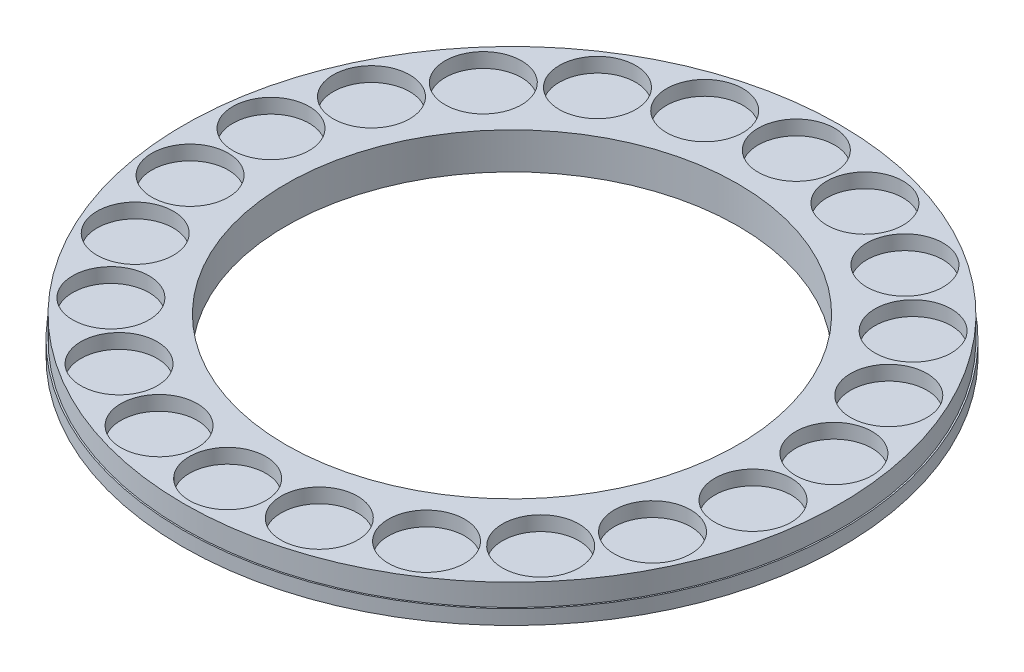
from build123d import *

# Parameters (mm, degrees)
SKETCH1_R          = 285.75
EXTRUDE1_DEPTH     = 19.05
SKETCH2_R          = 287.02
EXTRUDE2_DEPTH     = 12.7
SKETCH3_R          = 33.274
CUT_EXTRUDE1_DEPTH = 12.7
CIRPATTERN1_COUNT  = 22
SKETCH6_R          = 196.85
CUT_EXTRUDE5_DEPTH = 408.147422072


with BuildPart() as part:
    # Sketch1 → Extrude1 (new body)
    with BuildSketch(Plane(origin=(0, 0, 0), x_dir=(1, 0, 0), z_dir=(0, 1, 0))):
        with Locations(Location((0, 0, 0), (0, 0, 90))):
            Circle(SKETCH1_R)
    extrude(amount=EXTRUDE1_DEPTH)

    # Sketch2 → Extrude2 (add)
    with BuildSketch(Plane.XZ):
        with Locations(Location((0, 0, 0), (0, 0, 270))):
            Circle(SKETCH2_R)
    extrude(amount=EXTRUDE2_DEPTH)

    # Sketch3 → Cut-Extrude1 (cut)
    with BuildSketch(Plane(origin=(0, 19.05, 0), x_dir=(-1, 0, 0), z_dir=(0, 1, 0))):
        with Locations(Location((0, 247.65, 0), (0, 0, 90))):
            Circle(SKETCH3_R)
    cut_extrude1 = extrude(amount=-CUT_EXTRUDE1_DEPTH, mode=Mode.SUBTRACT)

    # CirPattern1: Cut-Extrude1 ×22 about axis
    cirpattern1_axis = Axis((0, 0, 0), (0, 1, 0))
    for i in range(1, CIRPATTERN1_COUNT):
        add(cut_extrude1.rotate(cirpattern1_axis, i * 360 / CIRPATTERN1_COUNT), mode=Mode.SUBTRACT)

    # Sketch6 → Cut-Extrude5 (cut, through all)
    with BuildSketch(Plane(origin=(0, 19.05, 0), x_dir=(-1, 0, 0), z_dir=(0, 1, 0))):
        with Locations(Location((0, 0, 0), (0, 0, 90))):
            Circle(SKETCH6_R)
    extrude(amount=-CUT_EXTRUDE5_DEPTH, mode=Mode.SUBTRACT)


solid = part.part
